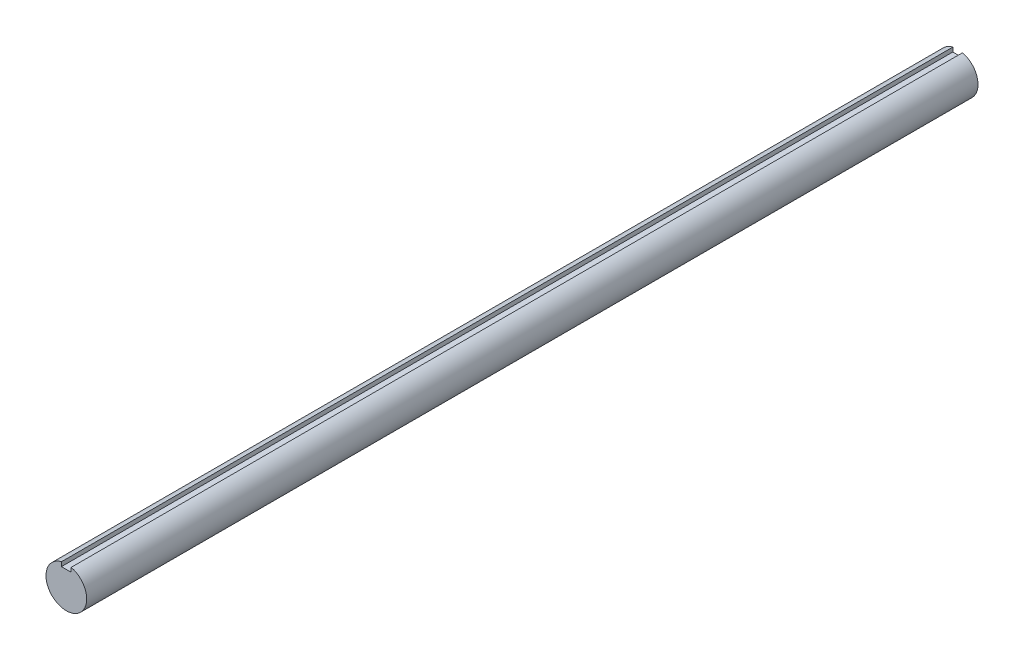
from build123d import *

# Parameters (mm, degrees)
EXTRUDE1_DEPTH = 173.96333


with BuildPart() as part:
    # Sketch1 → Extrude1 (new, symmetric)
    with BuildSketch(Plane.XY):
        with BuildLine():
            Line((1.905, 7.705509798), (1.905, 6.0325))
            Line((1.905, 6.0325), (-1.905, 6.0325))
            Line((-1.905, 6.0325), (-1.905, 7.705509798))
            ThreePointArc((-1.905, 7.705509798), (0, -7.9375), (1.905, 7.705509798))
        make_face()
    extrude(amount=EXTRUDE1_DEPTH, both=True)


solid = part.part
